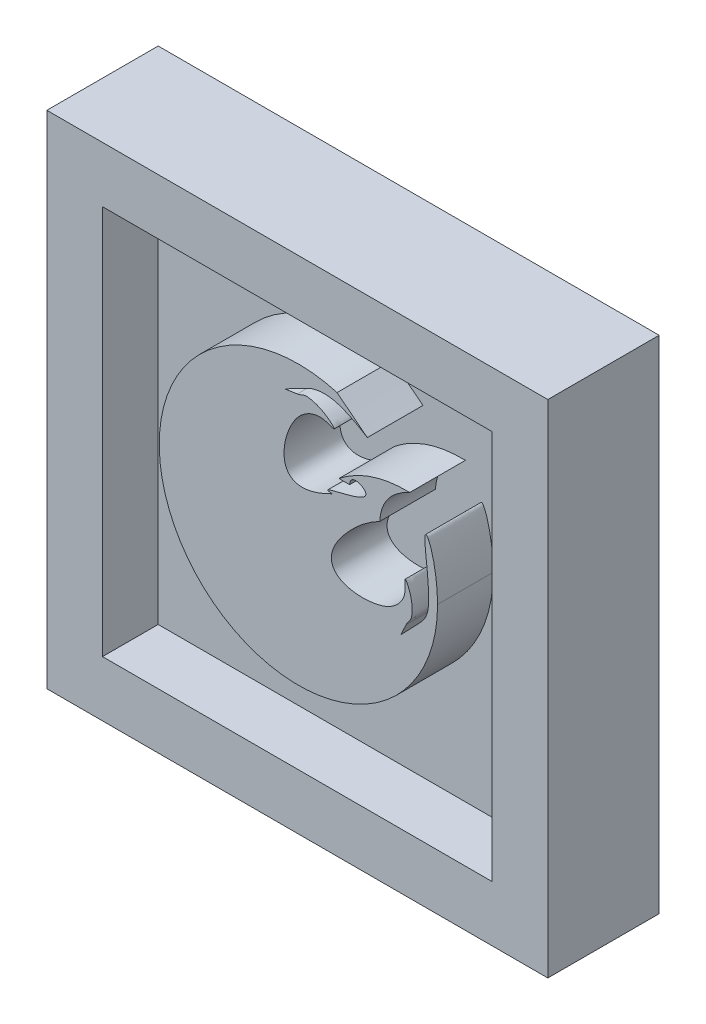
ISO-10303-21;
HEADER;
FILE_DESCRIPTION(('STEP AP214'),'2;1');
FILE_NAME('part.step','',(''),(''),'','','');
FILE_SCHEMA(('AUTOMOTIVE_DESIGN { 1 0 10303 214 1 1 1 1 }'));
ENDSEC;
DATA;
#1=APPLICATION_CONTEXT('core data for automotive mechanical design processes');
#2=APPLICATION_PROTOCOL_DEFINITION('international standard','automotive_design',2000,#1);
#3=PRODUCT_CONTEXT('',#1,'mechanical');
#4=PRODUCT('Part','Part','',(#3));
#5=PRODUCT_RELATED_PRODUCT_CATEGORY('part','',(#4));
#6=PRODUCT_DEFINITION_FORMATION('','',#4);
#7=PRODUCT_DEFINITION_CONTEXT('part definition',#1,'design');
#8=PRODUCT_DEFINITION('design','',#6,#7);
#9=PRODUCT_DEFINITION_SHAPE('','',#8);
#10=(LENGTH_UNIT() NAMED_UNIT(*) SI_UNIT(.MILLI.,.METRE.));
#11=(NAMED_UNIT(*) PLANE_ANGLE_UNIT() SI_UNIT($,.RADIAN.));
#12=(NAMED_UNIT(*) SI_UNIT($,.STERADIAN.) SOLID_ANGLE_UNIT());
#13=UNCERTAINTY_MEASURE_WITH_UNIT(LENGTH_MEASURE(1.E-05),#10,'distance_accuracy_value','');
#14=(GEOMETRIC_REPRESENTATION_CONTEXT(3) GLOBAL_UNCERTAINTY_ASSIGNED_CONTEXT((#13)) GLOBAL_UNIT_ASSIGNED_CONTEXT((#10,
#11,#12)) REPRESENTATION_CONTEXT('',''));
#15=CARTESIAN_POINT('',(0.,0.,0.));
#16=DIRECTION('',(0.,0.,1.));
#17=DIRECTION('',(1.,0.,0.));
#18=AXIS2_PLACEMENT_3D('',#15,#16,#17);
#19=CARTESIAN_POINT('',(0.,0.,10.));
#20=DIRECTION('',(0.,0.,-1.));
#21=DIRECTION('',(-1.,0.,0.));
#22=AXIS2_PLACEMENT_3D('',#19,#20,#21);
#23=PLANE('',#22);
#24=DIRECTION('',(0.,1.,0.));
#25=VECTOR('',#24,1.);
#26=CARTESIAN_POINT('',(35.,0.,10.));
#27=LINE('',#26,#25);
#28=CARTESIAN_POINT('',(35.,-35.,10.));
#29=VERTEX_POINT('',#28);
#30=CARTESIAN_POINT('',(35.,35.,10.));
#31=VERTEX_POINT('',#30);
#32=EDGE_CURVE('E204',#29,#31,#27,.T.);
#33=ORIENTED_EDGE('',*,*,#32,.T.);
#34=DIRECTION('',(-1.,0.,0.));
#35=VECTOR('',#34,1.);
#36=CARTESIAN_POINT('',(0.,35.,10.));
#37=LINE('',#36,#35);
#38=CARTESIAN_POINT('',(-35.,35.,10.));
#39=VERTEX_POINT('',#38);
#40=EDGE_CURVE('E207',#31,#39,#37,.T.);
#41=ORIENTED_EDGE('',*,*,#40,.T.);
#42=DIRECTION('',(0.,-1.,0.));
#43=VECTOR('',#42,1.);
#44=CARTESIAN_POINT('',(-35.,0.,10.));
#45=LINE('',#44,#43);
#46=CARTESIAN_POINT('',(-35.,-35.,10.));
#47=VERTEX_POINT('',#46);
#48=EDGE_CURVE('E224',#39,#47,#45,.T.);
#49=ORIENTED_EDGE('',*,*,#48,.T.);
#50=DIRECTION('',(1.,0.,0.));
#51=VECTOR('',#50,1.);
#52=CARTESIAN_POINT('',(0.,-35.,10.));
#53=LINE('',#52,#51);
#54=EDGE_CURVE('E228',#47,#29,#53,.T.);
#55=ORIENTED_EDGE('',*,*,#54,.T.);
#56=EDGE_LOOP('',(#33,#41,#49,#55));
#57=FACE_BOUND('',#56,.T.);
#58=DIRECTION('',(0.420310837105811,0.907380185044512,0.));
#59=VECTOR('',#58,1.);
#60=CARTESIAN_POINT('',(17.1415943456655,-7.94021953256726,10.));
#61=LINE('',#60,#59);
#62=CARTESIAN_POINT('',(18.6036895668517,-4.78380262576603,10.));
#63=VERTEX_POINT('',#62);
#64=CARTESIAN_POINT('',(19.5640305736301,-2.71058629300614,10.));
#65=VERTEX_POINT('',#64);
#66=EDGE_CURVE('E203',#63,#65,#61,.T.);
#67=ORIENTED_EDGE('',*,*,#66,.F.);
#68=DIRECTION('',(-0.693225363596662,-0.72072088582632,0.));
#69=VECTOR('',#68,1.);
#70=CARTESIAN_POINT('',(12.0535674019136,-11.5937234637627,10.));
#71=LINE('',#70,#69);
#72=CARTESIAN_POINT('',(21.8020186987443,-1.4586175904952,10.));
#73=VERTEX_POINT('',#72);
#74=EDGE_CURVE('E200',#73,#63,#71,.T.);
#75=ORIENTED_EDGE('',*,*,#74,.F.);
#76=CARTESIAN_POINT('',(25.1898639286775,3.20802241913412,10.));
#77=CARTESIAN_POINT('',(25.1889168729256,3.53021217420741,10.));
#78=CARTESIAN_POINT('',(25.0462224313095,9.69647983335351,10.));
#79=CARTESIAN_POINT('',(21.6124444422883,17.75553180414,10.));
#80=CARTESIAN_POINT('',(24.5933586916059,1.1855729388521,10.));
#81=CARTESIAN_POINT('',(22.6453662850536,-0.545309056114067,10.));
#82=CARTESIAN_POINT('',(21.8020186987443,-1.4586175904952,10.));
#83=B_SPLINE_CURVE_WITH_KNOTS('',3,(#76,#77,#78,#79,#80,#81,#82),.UNSPECIFIED.,.F.,.F.,(4,1,1,1,
4),(0.,0.0044043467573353,0.0880869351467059,0.17443446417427,0.24880130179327),.UNSPECIFIED.);
#84=CARTESIAN_POINT('',(25.1898639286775,3.20802241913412,10.));
#85=VERTEX_POINT('',#84);
#86=EDGE_CURVE('E598',#85,#73,#83,.T.);
#87=ORIENTED_EDGE('',*,*,#86,.F.);
#88=CARTESIAN_POINT('',(0.189971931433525,3.13453686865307,10.));
#89=DIRECTION('',(0.,0.,1.));
#90=DIRECTION('',(1.,0.,0.));
#91=AXIS2_PLACEMENT_3D('',#88,#89,#90);
#92=CIRCLE('',#91,24.9999999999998);
#93=CARTESIAN_POINT('',(7.13359346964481,27.1509087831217,10.));
#94=VERTEX_POINT('',#93);
#95=EDGE_CURVE('E592',#94,#85,#92,.T.);
#96=ORIENTED_EDGE('',*,*,#95,.F.);
#97=CARTESIAN_POINT('',(7.13359346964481,27.1509087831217,10.));
#98=CARTESIAN_POINT('',(17.0731444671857,19.1476729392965,10.));
#99=CARTESIAN_POINT('',(8.74265520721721,26.9548517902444,10.));
#100=CARTESIAN_POINT('',(2.9448311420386,25.7220715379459,10.));
#101=CARTESIAN_POINT('',(1.83191762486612,25.1681842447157,10.));
#102=B_SPLINE_CURVE_WITH_KNOTS('',3,(#97,#98,#99,#100,#101),.UNSPECIFIED.,.F.,.F.,(4,1,4),(0.,
0.17443446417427,0.24880130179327),.UNSPECIFIED.);
#103=CARTESIAN_POINT('',(1.83191762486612,25.1681842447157,10.));
#104=VERTEX_POINT('',#103);
#105=EDGE_CURVE('E588',#94,#104,#102,.T.);
#106=ORIENTED_EDGE('',*,*,#105,.T.);
#107=DIRECTION('',(-0.885995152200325,-0.463694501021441,0.));
#108=VECTOR('',#107,1.);
#109=CARTESIAN_POINT('',(-9.94598696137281,19.0040990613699,10.));
#110=LINE('',#109,#108);
#111=CARTESIAN_POINT('',(-2.25579216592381,23.0288400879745,10.));
#112=VERTEX_POINT('',#111);
#113=EDGE_CURVE('E586',#104,#112,#110,.T.);
#114=ORIENTED_EDGE('',*,*,#113,.T.);
#115=DIRECTION('',(0.988772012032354,0.149431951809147,0.));
#116=VECTOR('',#115,1.);
#117=CARTESIAN_POINT('',(-3.45297790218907,22.8479108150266,10.));
#118=LINE('',#117,#116);
#119=CARTESIAN_POINT('',(0.00339011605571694,23.3702676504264,10.));
#120=VERTEX_POINT('',#119);
#121=EDGE_CURVE('E581',#112,#120,#118,.T.);
#122=ORIENTED_EDGE('',*,*,#121,.T.);
#123=CARTESIAN_POINT('',(0.00339011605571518,23.3702676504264,10.));
#124=CARTESIAN_POINT('',(0.066357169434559,23.3756988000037,10.));
#125=CARTESIAN_POINT('',(0.484855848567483,23.4390376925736,10.));
#126=CARTESIAN_POINT('',(1.3264638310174,23.9828046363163,10.));
#127=CARTESIAN_POINT('',(2.88716056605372,23.6558605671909,10.));
#128=CARTESIAN_POINT('',(4.94908274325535,22.9532227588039,10.));
#129=CARTESIAN_POINT('',(7.41603768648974,20.8184666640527,10.));
#130=CARTESIAN_POINT('',(5.84912331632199,21.4695709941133,10.));
#131=CARTESIAN_POINT('',(3.80788191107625,22.0283242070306,10.));
#132=CARTESIAN_POINT('',(0.875912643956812,21.0854310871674,10.));
#133=CARTESIAN_POINT('',(-3.50081534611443,15.0424858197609,10.));
#134=CARTESIAN_POINT('',(-3.23071334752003,6.09901635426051,10.));
#135=CARTESIAN_POINT('',(6.24559325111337,10.9544086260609,10.));
#136=B_SPLINE_CURVE_WITH_KNOTS('',3,(#123,#124,#125,#126,#127,#128,#129,#130,#131,#132,#133,
#134,#135),.UNSPECIFIED.,.F.,.F.,(4,1,1,1,1,1,1,1,1,1,4),(0.337693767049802,0.341426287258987,
0.362746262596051,0.394756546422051,0.429544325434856,0.500578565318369,0.540544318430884,
0.562560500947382,0.621530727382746,0.71049127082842,1.),.UNSPECIFIED.);
#137=CARTESIAN_POINT('',(6.24559325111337,10.9544086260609,10.));
#138=VERTEX_POINT('',#137);
#139=EDGE_CURVE('E574',#120,#138,#136,.T.);
#140=ORIENTED_EDGE('',*,*,#139,.T.);
#141=CARTESIAN_POINT('',(9.39262278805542,13.9517788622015,10.));
#142=CARTESIAN_POINT('',(9.49953216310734,16.046141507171,10.));
#143=CARTESIAN_POINT('',(13.3766960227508,14.4041121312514,10.));
#144=CARTESIAN_POINT('',(10.3429198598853,11.9903554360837,10.));
#145=CARTESIAN_POINT('',(3.42647018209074,11.2161905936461,10.));
#146=CARTESIAN_POINT('',(6.24559325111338,10.9544086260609,10.));
#147=B_SPLINE_CURVE_WITH_KNOTS('',3,(#141,#142,#143,#144,#145,#146),.UNSPECIFIED.,.F.,.F.,(4,1,
1,4),(0.,0.343545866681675,0.483228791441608,1.),.UNSPECIFIED.);
#148=CARTESIAN_POINT('',(9.39262278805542,13.9517788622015,10.));
#149=VERTEX_POINT('',#148);
#150=EDGE_CURVE('E569',#149,#138,#147,.T.);
#151=ORIENTED_EDGE('',*,*,#150,.F.);
#152=DIRECTION('',(1.,0.,0.));
#153=VECTOR('',#152,1.);
#154=CARTESIAN_POINT('',(0.,13.9517788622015,10.));
#155=LINE('',#154,#153);
#156=CARTESIAN_POINT('',(7.47767809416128,13.9517788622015,10.));
#157=VERTEX_POINT('',#156);
#158=EDGE_CURVE('E563',#157,#149,#155,.T.);
#159=ORIENTED_EDGE('',*,*,#158,.F.);
#160=CARTESIAN_POINT('',(20.1899719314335,18.1345368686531,10.));
#161=CARTESIAN_POINT('',(12.9377850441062,18.2884555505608,10.));
#162=CARTESIAN_POINT('',(7.47767809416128,13.9517788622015,10.));
#163=B_SPLINE_CURVE_WITH_KNOTS('',2,(#160,#161,#162),.UNSPECIFIED.,.F.,.F.,(3,3),(0.,1.),.UNSPECIFIED.);
#164=CARTESIAN_POINT('',(20.1899719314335,18.1345368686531,10.));
#165=VERTEX_POINT('',#164);
#166=EDGE_CURVE('E555',#165,#157,#163,.T.);
#167=ORIENTED_EDGE('',*,*,#166,.F.);
#168=CARTESIAN_POINT('',(20.1899719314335,18.1345368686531,10.));
#169=CARTESIAN_POINT('',(15.0614562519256,15.7823312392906,10.));
#170=CARTESIAN_POINT('',(14.8148032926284,10.9544086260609,10.));
#171=B_SPLINE_CURVE_WITH_KNOTS('',2,(#168,#169,#170),.UNSPECIFIED.,.F.,.F.,(3,3),(0.,1.),.UNSPECIFIED.);
#172=CARTESIAN_POINT('',(14.8148032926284,10.9544086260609,10.));
#173=VERTEX_POINT('',#172);
#174=EDGE_CURVE('E548',#165,#173,#171,.T.);
#175=ORIENTED_EDGE('',*,*,#174,.T.);
#176=CARTESIAN_POINT('',(14.8148032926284,10.9544086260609,10.));
#177=CARTESIAN_POINT('',(11.7450168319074,9.33186975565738,10.));
#178=CARTESIAN_POINT('',(9.39262278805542,6.75836924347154,10.));
#179=B_SPLINE_CURVE_WITH_KNOTS('',2,(#176,#177,#178),.UNSPECIFIED.,.F.,.F.,(3,3),(0.,1.),.UNSPECIFIED.);
#180=CARTESIAN_POINT('',(9.39262278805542,6.75836924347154,10.));
#181=VERTEX_POINT('',#180);
#182=EDGE_CURVE('E53',#173,#181,#179,.T.);
#183=ORIENTED_EDGE('',*,*,#182,.T.);
#184=CARTESIAN_POINT('',(19.5640305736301,-2.71058629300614,10.));
#185=CARTESIAN_POINT('',(19.5868752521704,-2.6516586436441,10.));
#186=CARTESIAN_POINT('',(19.7648602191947,-2.26763480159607,10.));
#187=CARTESIAN_POINT('',(20.5225267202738,-1.61194588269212,10.));
#188=CARTESIAN_POINT('',(20.6456554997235,-0.0221326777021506,10.));
#189=CARTESIAN_POINT('',(20.5484614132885,2.15405119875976,10.));
#190=CARTESIAN_POINT('',(19.1898429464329,5.12005965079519,10.));
#191=CARTESIAN_POINT('',(19.3761670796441,3.4335126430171,10.));
#192=CARTESIAN_POINT('',(19.341022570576,1.31746999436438,10.));
#193=CARTESIAN_POINT('',(17.6148937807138,-1.2332104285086,10.));
#194=CARTESIAN_POINT('',(10.5881824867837,-3.7428446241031,10.));
#195=CARTESIAN_POINT('',(2.07808035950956,-0.979375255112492,10.));
#196=CARTESIAN_POINT('',(9.39262278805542,6.75836924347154,10.));
#197=B_SPLINE_CURVE_WITH_KNOTS('',3,(#184,#185,#186,#187,#188,#189,#190,#191,#192,#193,#194,
#195,#196),.UNSPECIFIED.,.F.,.F.,(4,1,1,1,1,1,1,1,1,1,4),(0.337693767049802,0.341426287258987,
0.362746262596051,0.394756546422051,0.429544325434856,0.500578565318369,0.540544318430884,
0.562560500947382,0.621530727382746,0.71049127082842,1.),.UNSPECIFIED.);
#198=EDGE_CURVE('E48',#65,#181,#197,.T.);
#199=ORIENTED_EDGE('',*,*,#198,.F.);
#200=EDGE_LOOP('',(#67,#75,#87,#96,#106,#114,#122,#140,#151,#159,#167,#175,#183,#199));
#201=FACE_BOUND('',#200,.T.);
#202=ADVANCED_FACE('F33',(#57,#201),#23,.F.);
#203=CARTESIAN_POINT('',(0.,0.,20.));
#204=DIRECTION('',(0.,0.,-1.));
#205=DIRECTION('',(-1.,0.,0.));
#206=AXIS2_PLACEMENT_3D('',#203,#204,#205);
#207=PLANE('',#206);
#208=DIRECTION('',(0.,1.,0.));
#209=VECTOR('',#208,1.);
#210=CARTESIAN_POINT('',(45.,-45.,20.));
#211=LINE('',#210,#209);
#212=CARTESIAN_POINT('',(45.,-45.,20.));
#213=VERTEX_POINT('',#212);
#214=CARTESIAN_POINT('',(45.,45.,20.));
#215=VERTEX_POINT('',#214);
#216=EDGE_CURVE('E240',#213,#215,#211,.T.);
#217=ORIENTED_EDGE('',*,*,#216,.T.);
#218=DIRECTION('',(-1.,0.,0.));
#219=VECTOR('',#218,1.);
#220=CARTESIAN_POINT('',(-45.,45.,20.));
#221=LINE('',#220,#219);
#222=CARTESIAN_POINT('',(-45.,45.,20.));
#223=VERTEX_POINT('',#222);
#224=EDGE_CURVE('E243',#215,#223,#221,.T.);
#225=ORIENTED_EDGE('',*,*,#224,.T.);
#226=DIRECTION('',(0.,-1.,0.));
#227=VECTOR('',#226,1.);
#228=CARTESIAN_POINT('',(-45.,-45.,20.));
#229=LINE('',#228,#227);
#230=CARTESIAN_POINT('',(-45.,-45.,20.));
#231=VERTEX_POINT('',#230);
#232=EDGE_CURVE('E246',#223,#231,#229,.T.);
#233=ORIENTED_EDGE('',*,*,#232,.T.);
#234=DIRECTION('',(1.,0.,0.));
#235=VECTOR('',#234,1.);
#236=CARTESIAN_POINT('',(-45.,-45.,20.));
#237=LINE('',#236,#235);
#238=EDGE_CURVE('E248',#231,#213,#237,.T.);
#239=ORIENTED_EDGE('',*,*,#238,.T.);
#240=EDGE_LOOP('',(#217,#225,#233,#239));
#241=FACE_BOUND('',#240,.T.);
#242=DIRECTION('',(0.,1.,0.));
#243=VECTOR('',#242,1.);
#244=CARTESIAN_POINT('',(35.,0.,20.));
#245=LINE('',#244,#243);
#246=CARTESIAN_POINT('',(35.,-35.,20.));
#247=VERTEX_POINT('',#246);
#248=CARTESIAN_POINT('',(35.,35.,20.));
#249=VERTEX_POINT('',#248);
#250=EDGE_CURVE('E232',#247,#249,#245,.T.);
#251=ORIENTED_EDGE('',*,*,#250,.F.);
#252=DIRECTION('',(1.,0.,0.));
#253=VECTOR('',#252,1.);
#254=CARTESIAN_POINT('',(0.,-35.,20.));
#255=LINE('',#254,#253);
#256=CARTESIAN_POINT('',(-35.,-35.,20.));
#257=VERTEX_POINT('',#256);
#258=EDGE_CURVE('E222',#257,#247,#255,.T.);
#259=ORIENTED_EDGE('',*,*,#258,.F.);
#260=DIRECTION('',(0.,-1.,0.));
#261=VECTOR('',#260,1.);
#262=CARTESIAN_POINT('',(-35.,0.,20.));
#263=LINE('',#262,#261);
#264=CARTESIAN_POINT('',(-35.,35.,20.));
#265=VERTEX_POINT('',#264);
#266=EDGE_CURVE('E236',#265,#257,#263,.T.);
#267=ORIENTED_EDGE('',*,*,#266,.F.);
#268=DIRECTION('',(-1.,0.,0.));
#269=VECTOR('',#268,1.);
#270=CARTESIAN_POINT('',(0.,35.,20.));
#271=LINE('',#270,#269);
#272=EDGE_CURVE('E234',#249,#265,#271,.T.);
#273=ORIENTED_EDGE('',*,*,#272,.F.);
#274=EDGE_LOOP('',(#251,#259,#267,#273));
#275=FACE_BOUND('',#274,.T.);
#276=ADVANCED_FACE('F282',(#241,#275),#207,.F.);
#277=CARTESIAN_POINT('',(45.,-45.,20.));
#278=DIRECTION('',(-1.,0.,0.));
#279=DIRECTION('',(0.,0.,1.));
#280=AXIS2_PLACEMENT_3D('',#277,#278,#279);
#281=PLANE('',#280);
#282=DIRECTION('',(0.,1.,0.));
#283=VECTOR('',#282,1.);
#284=CARTESIAN_POINT('',(45.,-45.,0.));
#285=LINE('',#284,#283);
#286=CARTESIAN_POINT('',(45.,-45.,0.));
#287=VERTEX_POINT('',#286);
#288=CARTESIAN_POINT('',(45.,45.,0.));
#289=VERTEX_POINT('',#288);
#290=EDGE_CURVE('E216',#287,#289,#285,.T.);
#291=ORIENTED_EDGE('',*,*,#290,.T.);
#292=DIRECTION('',(0.,0.,-1.));
#293=VECTOR('',#292,1.);
#294=CARTESIAN_POINT('',(45.,45.,20.));
#295=LINE('',#294,#293);
#296=EDGE_CURVE('E11',#215,#289,#295,.T.);
#297=ORIENTED_EDGE('',*,*,#296,.F.);
#298=ORIENTED_EDGE('',*,*,#216,.F.);
#299=DIRECTION('',(0.,0.,-1.));
#300=VECTOR('',#299,1.);
#301=CARTESIAN_POINT('',(45.,-45.,20.));
#302=LINE('',#301,#300);
#303=EDGE_CURVE('E250',#213,#287,#302,.T.);
#304=ORIENTED_EDGE('',*,*,#303,.T.);
#305=EDGE_LOOP('',(#291,#297,#298,#304));
#306=FACE_BOUND('',#305,.T.);
#307=ADVANCED_FACE('F35',(#306),#281,.F.);
#308=CARTESIAN_POINT('',(-45.,45.,20.));
#309=DIRECTION('',(0.,-1.,0.));
#310=DIRECTION('',(0.,0.,-1.));
#311=AXIS2_PLACEMENT_3D('',#308,#309,#310);
#312=PLANE('',#311);
#313=DIRECTION('',(-1.,0.,0.));
#314=VECTOR('',#313,1.);
#315=CARTESIAN_POINT('',(-45.,45.,0.));
#316=LINE('',#315,#314);
#317=CARTESIAN_POINT('',(-45.,45.,0.));
#318=VERTEX_POINT('',#317);
#319=EDGE_CURVE('E253',#289,#318,#316,.T.);
#320=ORIENTED_EDGE('',*,*,#319,.T.);
#321=DIRECTION('',(0.,0.,-1.));
#322=VECTOR('',#321,1.);
#323=CARTESIAN_POINT('',(-45.,45.,20.));
#324=LINE('',#323,#322);
#325=EDGE_CURVE('E41',#223,#318,#324,.T.);
#326=ORIENTED_EDGE('',*,*,#325,.F.);
#327=ORIENTED_EDGE('',*,*,#224,.F.);
#328=ORIENTED_EDGE('',*,*,#296,.T.);
#329=EDGE_LOOP('',(#320,#326,#327,#328));
#330=FACE_BOUND('',#329,.T.);
#331=ADVANCED_FACE('F284',(#330),#312,.F.);
#332=CARTESIAN_POINT('',(-45.,-45.,20.));
#333=DIRECTION('',(1.,0.,0.));
#334=DIRECTION('',(0.,0.,-1.));
#335=AXIS2_PLACEMENT_3D('',#332,#333,#334);
#336=PLANE('',#335);
#337=DIRECTION('',(0.,-1.,0.));
#338=VECTOR('',#337,1.);
#339=CARTESIAN_POINT('',(-45.,-45.,0.));
#340=LINE('',#339,#338);
#341=CARTESIAN_POINT('',(-45.,-45.,0.));
#342=VERTEX_POINT('',#341);
#343=EDGE_CURVE('E255',#318,#342,#340,.T.);
#344=ORIENTED_EDGE('',*,*,#343,.T.);
#345=DIRECTION('',(0.,0.,-1.));
#346=VECTOR('',#345,1.);
#347=CARTESIAN_POINT('',(-45.,-45.,20.));
#348=LINE('',#347,#346);
#349=EDGE_CURVE('E260',#231,#342,#348,.T.);
#350=ORIENTED_EDGE('',*,*,#349,.F.);
#351=ORIENTED_EDGE('',*,*,#232,.F.);
#352=ORIENTED_EDGE('',*,*,#325,.T.);
#353=EDGE_LOOP('',(#344,#350,#351,#352));
#354=FACE_BOUND('',#353,.T.);
#355=ADVANCED_FACE('F267',(#354),#336,.F.);
#356=CARTESIAN_POINT('',(-45.,-45.,20.));
#357=DIRECTION('',(0.,1.,0.));
#358=DIRECTION('',(0.,0.,1.));
#359=AXIS2_PLACEMENT_3D('',#356,#357,#358);
#360=PLANE('',#359);
#361=DIRECTION('',(1.,0.,0.));
#362=VECTOR('',#361,1.);
#363=CARTESIAN_POINT('',(-45.,-45.,0.));
#364=LINE('',#363,#362);
#365=EDGE_CURVE('E244',#342,#287,#364,.T.);
#366=ORIENTED_EDGE('',*,*,#365,.T.);
#367=ORIENTED_EDGE('',*,*,#303,.F.);
#368=ORIENTED_EDGE('',*,*,#238,.F.);
#369=ORIENTED_EDGE('',*,*,#349,.T.);
#370=EDGE_LOOP('',(#366,#367,#368,#369));
#371=FACE_BOUND('',#370,.T.);
#372=ADVANCED_FACE('F276',(#371),#360,.F.);
#373=CARTESIAN_POINT('',(0.,0.,0.));
#374=DIRECTION('',(0.,0.,-1.));
#375=DIRECTION('',(-1.,0.,0.));
#376=AXIS2_PLACEMENT_3D('',#373,#374,#375);
#377=PLANE('',#376);
#378=ORIENTED_EDGE('',*,*,#290,.F.);
#379=ORIENTED_EDGE('',*,*,#365,.F.);
#380=ORIENTED_EDGE('',*,*,#343,.F.);
#381=ORIENTED_EDGE('',*,*,#319,.F.);
#382=EDGE_LOOP('',(#378,#379,#380,#381));
#383=FACE_BOUND('',#382,.T.);
#384=ADVANCED_FACE('F273',(#383),#377,.T.);
#385=CARTESIAN_POINT('',(35.,-45.,20.));
#386=DIRECTION('',(-1.,0.,0.));
#387=DIRECTION('',(0.,0.,1.));
#388=AXIS2_PLACEMENT_3D('',#385,#386,#387);
#389=PLANE('',#388);
#390=ORIENTED_EDGE('',*,*,#32,.F.);
#391=DIRECTION('',(0.,0.,-1.));
#392=VECTOR('',#391,1.);
#393=CARTESIAN_POINT('',(35.,-35.,20.));
#394=LINE('',#393,#392);
#395=EDGE_CURVE('E218',#247,#29,#394,.T.);
#396=ORIENTED_EDGE('',*,*,#395,.F.);
#397=ORIENTED_EDGE('',*,*,#250,.T.);
#398=DIRECTION('',(0.,0.,-1.));
#399=VECTOR('',#398,1.);
#400=CARTESIAN_POINT('',(35.,35.,20.));
#401=LINE('',#400,#399);
#402=EDGE_CURVE('E213',#249,#31,#401,.T.);
#403=ORIENTED_EDGE('',*,*,#402,.T.);
#404=EDGE_LOOP('',(#390,#396,#397,#403));
#405=FACE_BOUND('',#404,.T.);
#406=ADVANCED_FACE('F304',(#405),#389,.T.);
#407=CARTESIAN_POINT('',(-45.,35.,20.));
#408=DIRECTION('',(0.,-1.,0.));
#409=DIRECTION('',(0.,0.,-1.));
#410=AXIS2_PLACEMENT_3D('',#407,#408,#409);
#411=PLANE('',#410);
#412=ORIENTED_EDGE('',*,*,#40,.F.);
#413=ORIENTED_EDGE('',*,*,#402,.F.);
#414=ORIENTED_EDGE('',*,*,#272,.T.);
#415=DIRECTION('',(0.,0.,-1.));
#416=VECTOR('',#415,1.);
#417=CARTESIAN_POINT('',(-35.,35.,20.));
#418=LINE('',#417,#416);
#419=EDGE_CURVE('E217',#265,#39,#418,.T.);
#420=ORIENTED_EDGE('',*,*,#419,.T.);
#421=EDGE_LOOP('',(#412,#413,#414,#420));
#422=FACE_BOUND('',#421,.T.);
#423=ADVANCED_FACE('F321',(#422),#411,.T.);
#424=CARTESIAN_POINT('',(-35.,-45.,20.));
#425=DIRECTION('',(1.,0.,0.));
#426=DIRECTION('',(0.,0.,-1.));
#427=AXIS2_PLACEMENT_3D('',#424,#425,#426);
#428=PLANE('',#427);
#429=ORIENTED_EDGE('',*,*,#48,.F.);
#430=ORIENTED_EDGE('',*,*,#419,.F.);
#431=ORIENTED_EDGE('',*,*,#266,.T.);
#432=DIRECTION('',(0.,0.,-1.));
#433=VECTOR('',#432,1.);
#434=CARTESIAN_POINT('',(-35.,-35.,20.));
#435=LINE('',#434,#433);
#436=EDGE_CURVE('E221',#257,#47,#435,.T.);
#437=ORIENTED_EDGE('',*,*,#436,.T.);
#438=EDGE_LOOP('',(#429,#430,#431,#437));
#439=FACE_BOUND('',#438,.T.);
#440=ADVANCED_FACE('F329',(#439),#428,.T.);
#441=CARTESIAN_POINT('',(-45.,-35.,20.));
#442=DIRECTION('',(0.,1.,0.));
#443=DIRECTION('',(0.,0.,1.));
#444=AXIS2_PLACEMENT_3D('',#441,#442,#443);
#445=PLANE('',#444);
#446=ORIENTED_EDGE('',*,*,#54,.F.);
#447=ORIENTED_EDGE('',*,*,#436,.F.);
#448=ORIENTED_EDGE('',*,*,#258,.T.);
#449=ORIENTED_EDGE('',*,*,#395,.T.);
#450=EDGE_LOOP('',(#446,#447,#448,#449));
#451=FACE_BOUND('',#450,.T.);
#452=ADVANCED_FACE('F299',(#451),#445,.T.);
#453=CARTESIAN_POINT('',(17.1415943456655,-7.94021953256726,20.));
#454=DIRECTION('',(-0.907380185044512,0.420310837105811,0.));
#455=DIRECTION('',(-0.420310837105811,-0.907380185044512,0.));
#456=AXIS2_PLACEMENT_3D('',#453,#454,#455);
#457=PLANE('',#456);
#458=ORIENTED_EDGE('',*,*,#66,.T.);
#459=DIRECTION('',(0.,0.,-1.));
#460=VECTOR('',#459,1.);
#461=CARTESIAN_POINT('',(19.564031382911,-2.71058666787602,20.));
#462=LINE('',#461,#460);
#463=CARTESIAN_POINT('',(19.564031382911,-2.71058666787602,20.));
#464=VERTEX_POINT('',#463);
#465=EDGE_CURVE('E184',#464,#65,#462,.T.);
#466=ORIENTED_EDGE('',*,*,#465,.F.);
#467=DIRECTION('',(0.420310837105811,0.907380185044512,0.));
#468=VECTOR('',#467,1.);
#469=CARTESIAN_POINT('',(17.1415943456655,-7.94021953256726,20.));
#470=LINE('',#469,#468);
#471=CARTESIAN_POINT('',(18.6036895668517,-4.78380262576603,20.));
#472=VERTEX_POINT('',#471);
#473=EDGE_CURVE('E191',#472,#464,#470,.T.);
#474=ORIENTED_EDGE('',*,*,#473,.F.);
#475=DIRECTION('',(0.,0.,-1.));
#476=VECTOR('',#475,1.);
#477=CARTESIAN_POINT('',(18.6036895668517,-4.78380262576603,20.));
#478=LINE('',#477,#476);
#479=EDGE_CURVE('E537',#472,#63,#478,.T.);
#480=ORIENTED_EDGE('',*,*,#479,.T.);
#481=EDGE_LOOP('',(#458,#466,#474,#480));
#482=FACE_BOUND('',#481,.T.);
#483=ADVANCED_FACE('F202',(#482),#457,.F.);
#484=CARTESIAN_POINT('',(19.5640305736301,-2.71058629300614,20.));
#485=CARTESIAN_POINT('',(19.5868752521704,-2.6516586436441,20.));
#486=CARTESIAN_POINT('',(19.7648602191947,-2.26763480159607,20.));
#487=CARTESIAN_POINT('',(20.5225267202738,-1.61194588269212,20.));
#488=CARTESIAN_POINT('',(20.6456554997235,-0.0221326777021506,20.));
#489=CARTESIAN_POINT('',(20.5484614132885,2.15405119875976,20.));
#490=CARTESIAN_POINT('',(19.1898429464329,5.12005965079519,20.));
#491=CARTESIAN_POINT('',(19.3761670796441,3.4335126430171,20.));
#492=CARTESIAN_POINT('',(19.341022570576,1.31746999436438,20.));
#493=CARTESIAN_POINT('',(17.6148937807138,-1.2332104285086,20.));
#494=CARTESIAN_POINT('',(10.5881824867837,-3.7428446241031,20.));
#495=CARTESIAN_POINT('',(2.07808035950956,-0.979375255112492,20.));
#496=CARTESIAN_POINT('',(9.39262278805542,6.75836924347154,20.));
#497=B_SPLINE_CURVE_WITH_KNOTS('',3,(#484,#485,#486,#487,#488,#489,#490,#491,#492,#493,#494,
#495,#496),.UNSPECIFIED.,.F.,.F.,(4,1,1,1,1,1,1,1,1,1,4),(0.337693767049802,0.341426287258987,
0.362746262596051,0.394756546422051,0.429544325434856,0.500578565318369,0.540544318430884,
0.562560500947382,0.621530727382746,0.71049127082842,1.),.UNSPECIFIED.);
#498=DIRECTION('',(0.,0.,-1.));
#499=VECTOR('',#498,1.);
#500=SURFACE_OF_LINEAR_EXTRUSION('',#497,#499);
#501=ORIENTED_EDGE('',*,*,#198,.T.);
#502=DIRECTION('',(0.,0.,-1.));
#503=VECTOR('',#502,1.);
#504=CARTESIAN_POINT('',(9.39262278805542,6.75836924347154,20.));
#505=LINE('',#504,#503);
#506=CARTESIAN_POINT('',(9.39262278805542,6.75836924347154,20.));
#507=VERTEX_POINT('',#506);
#508=EDGE_CURVE('E186',#507,#181,#505,.T.);
#509=ORIENTED_EDGE('',*,*,#508,.F.);
#510=EDGE_CURVE('E180',#464,#507,#497,.T.);
#511=ORIENTED_EDGE('',*,*,#510,.F.);
#512=ORIENTED_EDGE('',*,*,#465,.T.);
#513=EDGE_LOOP('',(#501,#509,#511,#512));
#514=FACE_BOUND('',#513,.T.);
#515=ADVANCED_FACE('F182',(#514),#500,.F.);
#516=CARTESIAN_POINT('',(14.8148032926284,10.9544086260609,20.));
#517=CARTESIAN_POINT('',(11.7450168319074,9.33186975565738,20.));
#518=CARTESIAN_POINT('',(9.39262278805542,6.75836924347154,20.));
#519=B_SPLINE_CURVE_WITH_KNOTS('',2,(#516,#517,#518),.UNSPECIFIED.,.F.,.F.,(3,3),(0.,1.),.UNSPECIFIED.);
#520=DIRECTION('',(0.,0.,-1.));
#521=VECTOR('',#520,1.);
#522=SURFACE_OF_LINEAR_EXTRUSION('',#519,#521);
#523=ORIENTED_EDGE('',*,*,#182,.F.);
#524=DIRECTION('',(0.,0.,-1.));
#525=VECTOR('',#524,1.);
#526=CARTESIAN_POINT('',(14.8148032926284,10.9544086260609,20.));
#527=LINE('',#526,#525);
#528=CARTESIAN_POINT('',(14.8148032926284,10.9544086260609,20.));
#529=VERTEX_POINT('',#528);
#530=EDGE_CURVE('E209',#529,#173,#527,.T.);
#531=ORIENTED_EDGE('',*,*,#530,.F.);
#532=EDGE_CURVE('E190',#529,#507,#519,.T.);
#533=ORIENTED_EDGE('',*,*,#532,.T.);
#534=ORIENTED_EDGE('',*,*,#508,.T.);
#535=EDGE_LOOP('',(#523,#531,#533,#534));
#536=FACE_BOUND('',#535,.T.);
#537=ADVANCED_FACE('F355',(#536),#522,.T.);
#538=CARTESIAN_POINT('',(20.1899719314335,18.1345368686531,20.));
#539=CARTESIAN_POINT('',(15.0614562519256,15.7823312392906,20.));
#540=CARTESIAN_POINT('',(14.8148032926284,10.9544086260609,20.));
#541=B_SPLINE_CURVE_WITH_KNOTS('',2,(#538,#539,#540),.UNSPECIFIED.,.F.,.F.,(3,3),(0.,1.),.UNSPECIFIED.);
#542=DIRECTION('',(0.,0.,-1.));
#543=VECTOR('',#542,1.);
#544=SURFACE_OF_LINEAR_EXTRUSION('',#541,#543);
#545=ORIENTED_EDGE('',*,*,#174,.F.);
#546=DIRECTION('',(0.,0.,-1.));
#547=VECTOR('',#546,1.);
#548=CARTESIAN_POINT('',(20.1899719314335,18.1345368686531,20.));
#549=LINE('',#548,#547);
#550=CARTESIAN_POINT('',(20.1899719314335,18.1345368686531,20.));
#551=VERTEX_POINT('',#550);
#552=EDGE_CURVE('E636',#551,#165,#549,.T.);
#553=ORIENTED_EDGE('',*,*,#552,.F.);
#554=EDGE_CURVE('E642',#551,#529,#541,.T.);
#555=ORIENTED_EDGE('',*,*,#554,.T.);
#556=ORIENTED_EDGE('',*,*,#530,.T.);
#557=EDGE_LOOP('',(#545,#553,#555,#556));
#558=FACE_BOUND('',#557,.T.);
#559=ADVANCED_FACE('F362',(#558),#544,.T.);
#560=CARTESIAN_POINT('',(20.1899719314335,18.1345368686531,20.));
#561=CARTESIAN_POINT('',(12.9377850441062,18.2884555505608,20.));
#562=CARTESIAN_POINT('',(7.47767809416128,13.9517788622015,20.));
#563=B_SPLINE_CURVE_WITH_KNOTS('',2,(#560,#561,#562),.UNSPECIFIED.,.F.,.F.,(3,3),(0.,1.),.UNSPECIFIED.);
#564=DIRECTION('',(0.,0.,-1.));
#565=VECTOR('',#564,1.);
#566=SURFACE_OF_LINEAR_EXTRUSION('',#563,#565);
#567=ORIENTED_EDGE('',*,*,#166,.T.);
#568=DIRECTION('',(0.,0.,-1.));
#569=VECTOR('',#568,1.);
#570=CARTESIAN_POINT('',(7.47767809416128,13.9517788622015,20.));
#571=LINE('',#570,#569);
#572=CARTESIAN_POINT('',(7.47767809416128,13.9517788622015,20.));
#573=VERTEX_POINT('',#572);
#574=EDGE_CURVE('E633',#573,#157,#571,.T.);
#575=ORIENTED_EDGE('',*,*,#574,.F.);
#576=EDGE_CURVE('E644',#551,#573,#563,.T.);
#577=ORIENTED_EDGE('',*,*,#576,.F.);
#578=ORIENTED_EDGE('',*,*,#552,.T.);
#579=EDGE_LOOP('',(#567,#575,#577,#578));
#580=FACE_BOUND('',#579,.T.);
#581=ADVANCED_FACE('F370',(#580),#566,.F.);
#582=CARTESIAN_POINT('',(0.,13.9517788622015,20.));
#583=DIRECTION('',(0.,1.,0.));
#584=DIRECTION('',(0.,0.,1.));
#585=AXIS2_PLACEMENT_3D('',#582,#583,#584);
#586=PLANE('',#585);
#587=ORIENTED_EDGE('',*,*,#158,.T.);
#588=DIRECTION('',(0.,0.,-1.));
#589=VECTOR('',#588,1.);
#590=CARTESIAN_POINT('',(9.39262278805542,13.9517788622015,20.));
#591=LINE('',#590,#589);
#592=CARTESIAN_POINT('',(9.39262278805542,13.9517788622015,20.));
#593=VERTEX_POINT('',#592);
#594=EDGE_CURVE('E630',#593,#149,#591,.T.);
#595=ORIENTED_EDGE('',*,*,#594,.F.);
#596=DIRECTION('',(1.,0.,0.));
#597=VECTOR('',#596,1.);
#598=CARTESIAN_POINT('',(0.,13.9517788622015,20.));
#599=LINE('',#598,#597);
#600=EDGE_CURVE('E663',#573,#593,#599,.T.);
#601=ORIENTED_EDGE('',*,*,#600,.F.);
#602=ORIENTED_EDGE('',*,*,#574,.T.);
#603=EDGE_LOOP('',(#587,#595,#601,#602));
#604=FACE_BOUND('',#603,.T.);
#605=ADVANCED_FACE('F378',(#604),#586,.F.);
#606=CARTESIAN_POINT('',(9.39262278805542,13.9517788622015,20.));
#607=CARTESIAN_POINT('',(9.49953216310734,16.046141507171,20.));
#608=CARTESIAN_POINT('',(13.3766960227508,14.4041121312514,20.));
#609=CARTESIAN_POINT('',(10.3429198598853,11.9903554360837,20.));
#610=CARTESIAN_POINT('',(3.42647018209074,11.2161905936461,20.));
#611=CARTESIAN_POINT('',(6.24559325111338,10.9544086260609,20.));
#612=B_SPLINE_CURVE_WITH_KNOTS('',3,(#606,#607,#608,#609,#610,#611),.UNSPECIFIED.,.F.,.F.,(4,1,
1,4),(0.,0.343545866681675,0.483228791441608,1.),.UNSPECIFIED.);
#613=DIRECTION('',(0.,0.,-1.));
#614=VECTOR('',#613,1.);
#615=SURFACE_OF_LINEAR_EXTRUSION('',#612,#614);
#616=ORIENTED_EDGE('',*,*,#150,.T.);
#617=DIRECTION('',(0.,0.,-1.));
#618=VECTOR('',#617,1.);
#619=CARTESIAN_POINT('',(6.24559325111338,10.9544086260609,20.));
#620=LINE('',#619,#618);
#621=CARTESIAN_POINT('',(6.24559325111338,10.9544086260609,20.));
#622=VERTEX_POINT('',#621);
#623=EDGE_CURVE('E627',#622,#138,#620,.T.);
#624=ORIENTED_EDGE('',*,*,#623,.F.);
#625=EDGE_CURVE('E668',#593,#622,#612,.T.);
#626=ORIENTED_EDGE('',*,*,#625,.F.);
#627=ORIENTED_EDGE('',*,*,#594,.T.);
#628=EDGE_LOOP('',(#616,#624,#626,#627));
#629=FACE_BOUND('',#628,.T.);
#630=ADVANCED_FACE('F386',(#629),#615,.F.);
#631=CARTESIAN_POINT('',(0.00339011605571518,23.3702676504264,20.));
#632=CARTESIAN_POINT('',(0.066357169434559,23.3756988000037,20.));
#633=CARTESIAN_POINT('',(0.484855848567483,23.4390376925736,20.));
#634=CARTESIAN_POINT('',(1.3264638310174,23.9828046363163,20.));
#635=CARTESIAN_POINT('',(2.88716056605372,23.6558605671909,20.));
#636=CARTESIAN_POINT('',(4.94908274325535,22.9532227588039,20.));
#637=CARTESIAN_POINT('',(7.41603768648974,20.8184666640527,20.));
#638=CARTESIAN_POINT('',(5.84912331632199,21.4695709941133,20.));
#639=CARTESIAN_POINT('',(3.80788191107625,22.0283242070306,20.));
#640=CARTESIAN_POINT('',(0.875912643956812,21.0854310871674,20.));
#641=CARTESIAN_POINT('',(-3.50081534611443,15.0424858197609,20.));
#642=CARTESIAN_POINT('',(-3.23071334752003,6.09901635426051,20.));
#643=CARTESIAN_POINT('',(6.24559325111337,10.9544086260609,20.));
#644=B_SPLINE_CURVE_WITH_KNOTS('',3,(#631,#632,#633,#634,#635,#636,#637,#638,#639,#640,#641,
#642,#643),.UNSPECIFIED.,.F.,.F.,(4,1,1,1,1,1,1,1,1,1,4),(0.337693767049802,0.341426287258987,
0.362746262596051,0.394756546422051,0.429544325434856,0.500578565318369,0.540544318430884,
0.562560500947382,0.621530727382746,0.71049127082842,1.),.UNSPECIFIED.);
#645=DIRECTION('',(0.,0.,-1.));
#646=VECTOR('',#645,1.);
#647=SURFACE_OF_LINEAR_EXTRUSION('',#644,#646);
#648=ORIENTED_EDGE('',*,*,#139,.F.);
#649=DIRECTION('',(0.,0.,-1.));
#650=VECTOR('',#649,1.);
#651=CARTESIAN_POINT('',(0.0033901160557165,23.3702676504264,20.));
#652=LINE('',#651,#650);
#653=CARTESIAN_POINT('',(0.0033901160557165,23.3702676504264,20.));
#654=VERTEX_POINT('',#653);
#655=EDGE_CURVE('E624',#654,#120,#652,.T.);
#656=ORIENTED_EDGE('',*,*,#655,.F.);
#657=EDGE_CURVE('E673',#654,#622,#644,.T.);
#658=ORIENTED_EDGE('',*,*,#657,.T.);
#659=ORIENTED_EDGE('',*,*,#623,.T.);
#660=EDGE_LOOP('',(#648,#656,#658,#659));
#661=FACE_BOUND('',#660,.T.);
#662=ADVANCED_FACE('F394',(#661),#647,.T.);
#663=CARTESIAN_POINT('',(-3.45297790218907,22.8479108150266,20.));
#664=DIRECTION('',(-0.149431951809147,0.988772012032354,0.));
#665=DIRECTION('',(-0.988772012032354,-0.149431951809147,0.));
#666=AXIS2_PLACEMENT_3D('',#663,#664,#665);
#667=PLANE('',#666);
#668=ORIENTED_EDGE('',*,*,#121,.F.);
#669=DIRECTION('',(0.,0.,-1.));
#670=VECTOR('',#669,1.);
#671=CARTESIAN_POINT('',(-2.25579216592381,23.0288400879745,20.));
#672=LINE('',#671,#670);
#673=CARTESIAN_POINT('',(-2.25579216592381,23.0288400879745,20.));
#674=VERTEX_POINT('',#673);
#675=EDGE_CURVE('E621',#674,#112,#672,.T.);
#676=ORIENTED_EDGE('',*,*,#675,.F.);
#677=DIRECTION('',(0.988772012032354,0.149431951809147,0.));
#678=VECTOR('',#677,1.);
#679=CARTESIAN_POINT('',(-3.45297790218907,22.8479108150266,20.));
#680=LINE('',#679,#678);
#681=EDGE_CURVE('E692',#674,#654,#680,.T.);
#682=ORIENTED_EDGE('',*,*,#681,.T.);
#683=ORIENTED_EDGE('',*,*,#655,.T.);
#684=EDGE_LOOP('',(#668,#676,#682,#683));
#685=FACE_BOUND('',#684,.T.);
#686=ADVANCED_FACE('F402',(#685),#667,.T.);
#687=CARTESIAN_POINT('',(-9.94598696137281,19.0040990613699,20.));
#688=DIRECTION('',(0.463694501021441,-0.885995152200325,0.));
#689=DIRECTION('',(0.885995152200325,0.463694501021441,0.));
#690=AXIS2_PLACEMENT_3D('',#687,#688,#689);
#691=PLANE('',#690);
#692=ORIENTED_EDGE('',*,*,#113,.F.);
#693=DIRECTION('',(0.,0.,-1.));
#694=VECTOR('',#693,1.);
#695=CARTESIAN_POINT('',(1.83191762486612,25.1681842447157,20.));
#696=LINE('',#695,#694);
#697=CARTESIAN_POINT('',(1.83191762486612,25.1681842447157,20.));
#698=VERTEX_POINT('',#697);
#699=EDGE_CURVE('E618',#698,#104,#696,.T.);
#700=ORIENTED_EDGE('',*,*,#699,.F.);
#701=DIRECTION('',(-0.885995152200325,-0.463694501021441,0.));
#702=VECTOR('',#701,1.);
#703=CARTESIAN_POINT('',(-9.94598696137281,19.0040990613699,20.));
#704=LINE('',#703,#702);
#705=EDGE_CURVE('E687',#698,#674,#704,.T.);
#706=ORIENTED_EDGE('',*,*,#705,.T.);
#707=ORIENTED_EDGE('',*,*,#675,.T.);
#708=EDGE_LOOP('',(#692,#700,#706,#707));
#709=FACE_BOUND('',#708,.T.);
#710=ADVANCED_FACE('F410',(#709),#691,.T.);
#711=CARTESIAN_POINT('',(7.13359346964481,27.1509087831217,20.));
#712=CARTESIAN_POINT('',(17.0731444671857,19.1476729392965,20.));
#713=CARTESIAN_POINT('',(8.74265520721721,26.9548517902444,20.));
#714=CARTESIAN_POINT('',(2.9448311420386,25.7220715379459,20.));
#715=CARTESIAN_POINT('',(1.83191762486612,25.1681842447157,20.));
#716=B_SPLINE_CURVE_WITH_KNOTS('',3,(#711,#712,#713,#714,#715),.UNSPECIFIED.,.F.,.F.,(4,1,4),
(0.,0.17443446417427,0.24880130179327),.UNSPECIFIED.);
#717=DIRECTION('',(0.,0.,-1.));
#718=VECTOR('',#717,1.);
#719=SURFACE_OF_LINEAR_EXTRUSION('',#716,#718);
#720=ORIENTED_EDGE('',*,*,#105,.F.);
#721=DIRECTION('',(0.,0.,-1.));
#722=VECTOR('',#721,1.);
#723=CARTESIAN_POINT('',(7.13359346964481,27.1509087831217,20.));
#724=LINE('',#723,#722);
#725=CARTESIAN_POINT('',(7.13359346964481,27.1509087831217,20.));
#726=VERTEX_POINT('',#725);
#727=EDGE_CURVE('E615',#726,#94,#724,.T.);
#728=ORIENTED_EDGE('',*,*,#727,.F.);
#729=EDGE_CURVE('E681',#726,#698,#716,.T.);
#730=ORIENTED_EDGE('',*,*,#729,.T.);
#731=ORIENTED_EDGE('',*,*,#699,.T.);
#732=EDGE_LOOP('',(#720,#728,#730,#731));
#733=FACE_BOUND('',#732,.T.);
#734=ADVANCED_FACE('F418',(#733),#719,.T.);
#735=CARTESIAN_POINT('',(0.189971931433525,3.13453686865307,20.));
#736=DIRECTION('',(0.,0.,-1.));
#737=DIRECTION('',(-1.,0.,0.));
#738=AXIS2_PLACEMENT_3D('',#735,#736,#737);
#739=CYLINDRICAL_SURFACE('',#738,24.9999999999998);
#740=ORIENTED_EDGE('',*,*,#95,.T.);
#741=DIRECTION('',(0.,0.,-1.));
#742=VECTOR('',#741,1.);
#743=CARTESIAN_POINT('',(25.1898639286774,3.20802241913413,20.));
#744=LINE('',#743,#742);
#745=CARTESIAN_POINT('',(25.1898639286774,3.20802241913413,20.));
#746=VERTEX_POINT('',#745);
#747=EDGE_CURVE('E612',#746,#85,#744,.T.);
#748=ORIENTED_EDGE('',*,*,#747,.F.);
#749=CARTESIAN_POINT('',(0.189971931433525,3.13453686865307,20.));
#750=DIRECTION('',(0.,0.,1.));
#751=DIRECTION('',(1.,0.,0.));
#752=AXIS2_PLACEMENT_3D('',#749,#750,#751);
#753=CIRCLE('',#752,24.9999999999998);
#754=EDGE_CURVE('E531',#726,#746,#753,.T.);
#755=ORIENTED_EDGE('',*,*,#754,.F.);
#756=ORIENTED_EDGE('',*,*,#727,.T.);
#757=EDGE_LOOP('',(#740,#748,#755,#756));
#758=FACE_BOUND('',#757,.T.);
#759=ADVANCED_FACE('F426',(#758),#739,.T.);
#760=CARTESIAN_POINT('',(25.1898639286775,3.20802241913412,20.));
#761=CARTESIAN_POINT('',(25.1889168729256,3.53021217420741,20.));
#762=CARTESIAN_POINT('',(25.0462224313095,9.69647983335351,20.));
#763=CARTESIAN_POINT('',(21.6124444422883,17.75553180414,20.));
#764=CARTESIAN_POINT('',(24.5933586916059,1.1855729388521,20.));
#765=CARTESIAN_POINT('',(22.6453662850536,-0.545309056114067,20.));
#766=CARTESIAN_POINT('',(21.8020186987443,-1.4586175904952,20.));
#767=B_SPLINE_CURVE_WITH_KNOTS('',3,(#760,#761,#762,#763,#764,#765,#766),.UNSPECIFIED.,.F.,.F.,
(4,1,1,1,4),(0.,0.0044043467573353,0.0880869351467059,0.17443446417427,0.24880130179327),.UNSPECIFIED.);
#768=DIRECTION('',(0.,0.,-1.));
#769=VECTOR('',#768,1.);
#770=SURFACE_OF_LINEAR_EXTRUSION('',#767,#769);
#771=ORIENTED_EDGE('',*,*,#86,.T.);
#772=DIRECTION('',(0.,0.,-1.));
#773=VECTOR('',#772,1.);
#774=CARTESIAN_POINT('',(21.8020186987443,-1.4586175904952,20.));
#775=LINE('',#774,#773);
#776=CARTESIAN_POINT('',(21.8020186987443,-1.4586175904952,20.));
#777=VERTEX_POINT('',#776);
#778=EDGE_CURVE('E609',#777,#73,#775,.T.);
#779=ORIENTED_EDGE('',*,*,#778,.F.);
#780=EDGE_CURVE('E525',#746,#777,#767,.T.);
#781=ORIENTED_EDGE('',*,*,#780,.F.);
#782=ORIENTED_EDGE('',*,*,#747,.T.);
#783=EDGE_LOOP('',(#771,#779,#781,#782));
#784=FACE_BOUND('',#783,.T.);
#785=ADVANCED_FACE('F434',(#784),#770,.F.);
#786=CARTESIAN_POINT('',(12.0535674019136,-11.5937234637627,20.));
#787=DIRECTION('',(0.72072088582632,-0.693225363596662,0.));
#788=DIRECTION('',(0.693225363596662,0.72072088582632,0.));
#789=AXIS2_PLACEMENT_3D('',#786,#787,#788);
#790=PLANE('',#789);
#791=ORIENTED_EDGE('',*,*,#74,.T.);
#792=ORIENTED_EDGE('',*,*,#479,.F.);
#793=DIRECTION('',(-0.693225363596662,-0.72072088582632,0.));
#794=VECTOR('',#793,1.);
#795=CARTESIAN_POINT('',(12.0535674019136,-11.5937234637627,20.));
#796=LINE('',#795,#794);
#797=EDGE_CURVE('E196',#777,#472,#796,.T.);
#798=ORIENTED_EDGE('',*,*,#797,.F.);
#799=ORIENTED_EDGE('',*,*,#778,.T.);
#800=EDGE_LOOP('',(#791,#792,#798,#799));
#801=FACE_BOUND('',#800,.T.);
#802=ADVANCED_FACE('F442',(#801),#790,.F.);
#803=CARTESIAN_POINT('',(0.,0.,20.));
#804=DIRECTION('',(0.,0.,1.));
#805=DIRECTION('',(1.,0.,0.));
#806=AXIS2_PLACEMENT_3D('',#803,#804,#805);
#807=PLANE('',#806);
#808=ORIENTED_EDGE('',*,*,#473,.T.);
#809=ORIENTED_EDGE('',*,*,#510,.T.);
#810=ORIENTED_EDGE('',*,*,#532,.F.);
#811=ORIENTED_EDGE('',*,*,#554,.F.);
#812=ORIENTED_EDGE('',*,*,#576,.T.);
#813=ORIENTED_EDGE('',*,*,#600,.T.);
#814=ORIENTED_EDGE('',*,*,#625,.T.);
#815=ORIENTED_EDGE('',*,*,#657,.F.);
#816=ORIENTED_EDGE('',*,*,#681,.F.);
#817=ORIENTED_EDGE('',*,*,#705,.F.);
#818=ORIENTED_EDGE('',*,*,#729,.F.);
#819=ORIENTED_EDGE('',*,*,#754,.T.);
#820=ORIENTED_EDGE('',*,*,#780,.T.);
#821=ORIENTED_EDGE('',*,*,#797,.T.);
#822=EDGE_LOOP('',(#808,#809,#810,#811,#812,#813,#814,#815,#816,#817,#818,#819,#820,#821));
#823=FACE_BOUND('',#822,.T.);
#824=ADVANCED_FACE('F194',(#823),#807,.T.);
#825=CLOSED_SHELL('',(#202,#276,#307,#331,#355,#372,#384,#406,#423,#440,#452,#483,#515,#537,
#559,#581,#605,#630,#662,#686,#710,#734,#759,#785,#802,#824));
#826=MANIFOLD_SOLID_BREP('B2',#825);
#827=ADVANCED_BREP_SHAPE_REPRESENTATION('',(#18,#826),#14);
#828=SHAPE_DEFINITION_REPRESENTATION(#9,#827);
ENDSEC;
END-ISO-10303-21;
